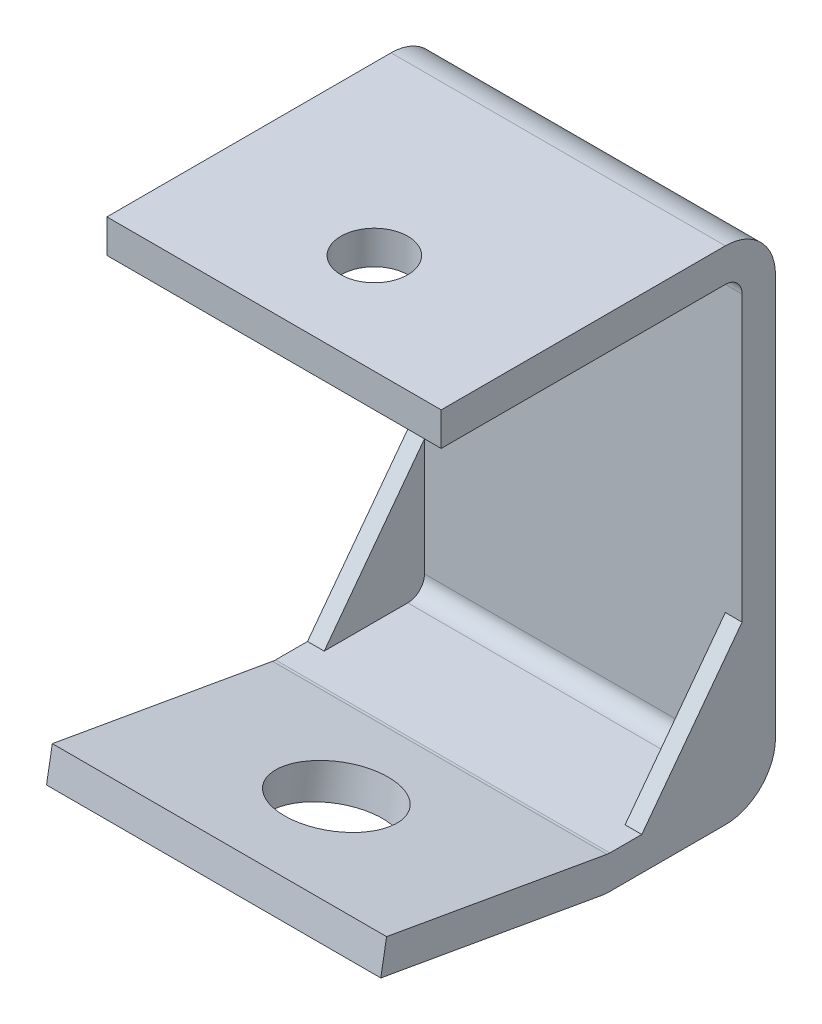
ISO-10303-21;
HEADER;
FILE_DESCRIPTION(('STEP AP214'),'2;1');
FILE_NAME('part.step','',(''),(''),'','','');
FILE_SCHEMA(('AUTOMOTIVE_DESIGN { 1 0 10303 214 1 1 1 1 }'));
ENDSEC;
DATA;
#1=APPLICATION_CONTEXT('core data for automotive mechanical design processes');
#2=APPLICATION_PROTOCOL_DEFINITION('international standard','automotive_design',2000,#1);
#3=PRODUCT_CONTEXT('',#1,'mechanical');
#4=PRODUCT('Part','Part','',(#3));
#5=PRODUCT_RELATED_PRODUCT_CATEGORY('part','',(#4));
#6=PRODUCT_DEFINITION_FORMATION('','',#4);
#7=PRODUCT_DEFINITION_CONTEXT('part definition',#1,'design');
#8=PRODUCT_DEFINITION('design','',#6,#7);
#9=PRODUCT_DEFINITION_SHAPE('','',#8);
#10=(LENGTH_UNIT() NAMED_UNIT(*) SI_UNIT(.MILLI.,.METRE.));
#11=(NAMED_UNIT(*) PLANE_ANGLE_UNIT() SI_UNIT($,.RADIAN.));
#12=(NAMED_UNIT(*) SI_UNIT($,.STERADIAN.) SOLID_ANGLE_UNIT());
#13=UNCERTAINTY_MEASURE_WITH_UNIT(LENGTH_MEASURE(1.E-05),#10,'distance_accuracy_value','');
#14=(GEOMETRIC_REPRESENTATION_CONTEXT(3) GLOBAL_UNCERTAINTY_ASSIGNED_CONTEXT((#13)) GLOBAL_UNIT_ASSIGNED_CONTEXT((#10,
#11,#12)) REPRESENTATION_CONTEXT('',''));
#15=CARTESIAN_POINT('',(0.,0.,0.));
#16=DIRECTION('',(0.,0.,1.));
#17=DIRECTION('',(1.,0.,0.));
#18=AXIS2_PLACEMENT_3D('',#15,#16,#17);
#19=CARTESIAN_POINT('',(31.75,3.175,3.175));
#20=DIRECTION('',(-1.,0.,0.));
#21=DIRECTION('',(0.,0.,1.));
#22=AXIS2_PLACEMENT_3D('',#19,#20,#21);
#23=CYLINDRICAL_SURFACE('',#22,3.175);
#24=DIRECTION('',(-1.,0.,0.));
#25=VECTOR('',#24,1.);
#26=CARTESIAN_POINT('',(31.75,3.175,0.));
#27=LINE('',#26,#25);
#28=CARTESIAN_POINT('',(28.575,3.175,0.));
#29=VERTEX_POINT('',#28);
#30=CARTESIAN_POINT('',(-28.575,3.175,0.));
#31=VERTEX_POINT('',#30);
#32=EDGE_CURVE('E325',#29,#31,#27,.T.);
#33=ORIENTED_EDGE('',*,*,#32,.T.);
#34=CARTESIAN_POINT('',(-28.575,3.175,3.175));
#35=DIRECTION('',(1.,0.,0.));
#36=DIRECTION('',(0.,0.,-1.));
#37=AXIS2_PLACEMENT_3D('',#34,#35,#36);
#38=CIRCLE('',#37,3.175);
#39=CARTESIAN_POINT('',(-28.575,0.,3.175));
#40=VERTEX_POINT('',#39);
#41=EDGE_CURVE('E197',#40,#31,#38,.T.);
#42=ORIENTED_EDGE('',*,*,#41,.F.);
#43=DIRECTION('',(-1.,0.,0.));
#44=VECTOR('',#43,1.);
#45=CARTESIAN_POINT('',(31.75,0.,3.175));
#46=LINE('',#45,#44);
#47=CARTESIAN_POINT('',(28.575,0.,3.175));
#48=VERTEX_POINT('',#47);
#49=EDGE_CURVE('E196',#48,#40,#46,.T.);
#50=ORIENTED_EDGE('',*,*,#49,.F.);
#51=CARTESIAN_POINT('',(28.575,3.175,3.175));
#52=DIRECTION('',(1.,0.,0.));
#53=DIRECTION('',(0.,0.,-1.));
#54=AXIS2_PLACEMENT_3D('',#51,#52,#53);
#55=CIRCLE('',#54,3.175);
#56=EDGE_CURVE('E208',#48,#29,#55,.T.);
#57=ORIENTED_EDGE('',*,*,#56,.T.);
#58=EDGE_LOOP('',(#33,#42,#50,#57));
#59=FACE_BOUND('',#58,.T.);
#60=ADVANCED_FACE('F37',(#59),#23,.F.);
#61=CARTESIAN_POINT('',(31.75,3.175,0.));
#62=DIRECTION('',(0.,0.,1.));
#63=DIRECTION('',(1.,0.,0.));
#64=AXIS2_PLACEMENT_3D('',#61,#62,#63);
#65=PLANE('',#64);
#66=DIRECTION('',(-1.,0.,0.));
#67=VECTOR('',#66,1.);
#68=CARTESIAN_POINT('',(-28.575,25.4,0.));
#69=LINE('',#68,#67);
#70=CARTESIAN_POINT('',(-28.575,25.4,0.));
#71=VERTEX_POINT('',#70);
#72=CARTESIAN_POINT('',(-31.75,25.4,0.));
#73=VERTEX_POINT('',#72);
#74=EDGE_CURVE('E184',#71,#73,#69,.T.);
#75=ORIENTED_EDGE('',*,*,#74,.F.);
#76=DIRECTION('',(0.,1.,0.));
#77=VECTOR('',#76,1.);
#78=CARTESIAN_POINT('',(-28.575,3.175,0.));
#79=LINE('',#78,#77);
#80=EDGE_CURVE('E191',#31,#71,#79,.T.);
#81=ORIENTED_EDGE('',*,*,#80,.F.);
#82=ORIENTED_EDGE('',*,*,#32,.F.);
#83=DIRECTION('',(0.,1.,0.));
#84=VECTOR('',#83,1.);
#85=CARTESIAN_POINT('',(28.575,3.175,0.));
#86=LINE('',#85,#84);
#87=CARTESIAN_POINT('',(28.575,25.4,0.));
#88=VERTEX_POINT('',#87);
#89=EDGE_CURVE('E61',#29,#88,#86,.T.);
#90=ORIENTED_EDGE('',*,*,#89,.T.);
#91=DIRECTION('',(1.,0.,0.));
#92=VECTOR('',#91,1.);
#93=CARTESIAN_POINT('',(28.575,25.4,0.));
#94=LINE('',#93,#92);
#95=CARTESIAN_POINT('',(31.75,25.4,0.));
#96=VERTEX_POINT('',#95);
#97=EDGE_CURVE('E217',#88,#96,#94,.T.);
#98=ORIENTED_EDGE('',*,*,#97,.T.);
#99=DIRECTION('',(0.,1.,0.));
#100=VECTOR('',#99,1.);
#101=CARTESIAN_POINT('',(31.75,3.175,0.));
#102=LINE('',#101,#100);
#103=CARTESIAN_POINT('',(31.75,79.375,0.));
#104=VERTEX_POINT('',#103);
#105=EDGE_CURVE('E238',#96,#104,#102,.T.);
#106=ORIENTED_EDGE('',*,*,#105,.T.);
#107=DIRECTION('',(-1.,0.,0.));
#108=VECTOR('',#107,1.);
#109=CARTESIAN_POINT('',(31.75,79.375,0.));
#110=LINE('',#109,#108);
#111=CARTESIAN_POINT('',(-31.75,79.375,0.));
#112=VERTEX_POINT('',#111);
#113=EDGE_CURVE('E328',#104,#112,#110,.T.);
#114=ORIENTED_EDGE('',*,*,#113,.T.);
#115=DIRECTION('',(0.,1.,0.));
#116=VECTOR('',#115,1.);
#117=CARTESIAN_POINT('',(-31.75,3.175,0.));
#118=LINE('',#117,#116);
#119=EDGE_CURVE('E275',#73,#112,#118,.T.);
#120=ORIENTED_EDGE('',*,*,#119,.F.);
#121=EDGE_LOOP('',(#75,#81,#82,#90,#98,#106,#114,#120));
#122=FACE_BOUND('',#121,.T.);
#123=ADVANCED_FACE('F418',(#122),#65,.T.);
#124=CARTESIAN_POINT('',(31.75,0.,25.1222234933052));
#125=DIRECTION('',(0.,1.,0.));
#126=DIRECTION('',(0.,0.,1.));
#127=AXIS2_PLACEMENT_3D('',#124,#125,#126);
#128=PLANE('',#127);
#129=DIRECTION('',(-1.,0.,0.));
#130=VECTOR('',#129,1.);
#131=CARTESIAN_POINT('',(-28.575,0.,19.05));
#132=LINE('',#131,#130);
#133=CARTESIAN_POINT('',(-28.575,0.,19.05));
#134=VERTEX_POINT('',#133);
#135=CARTESIAN_POINT('',(-31.75,0.,19.05));
#136=VERTEX_POINT('',#135);
#137=EDGE_CURVE('E175',#134,#136,#132,.T.);
#138=ORIENTED_EDGE('',*,*,#137,.T.);
#139=DIRECTION('',(0.,0.,-1.));
#140=VECTOR('',#139,1.);
#141=CARTESIAN_POINT('',(-31.75,0.,25.1222234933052));
#142=LINE('',#141,#140);
#143=CARTESIAN_POINT('',(-31.75,0.,25.1222234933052));
#144=VERTEX_POINT('',#143);
#145=EDGE_CURVE('E277',#144,#136,#142,.T.);
#146=ORIENTED_EDGE('',*,*,#145,.F.);
#147=DIRECTION('',(-1.,0.,0.));
#148=VECTOR('',#147,1.);
#149=CARTESIAN_POINT('',(31.75,0.,25.1222234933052));
#150=LINE('',#149,#148);
#151=CARTESIAN_POINT('',(31.75,0.,25.1222234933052));
#152=VERTEX_POINT('',#151);
#153=EDGE_CURVE('E322',#152,#144,#150,.T.);
#154=ORIENTED_EDGE('',*,*,#153,.F.);
#155=DIRECTION('',(0.,0.,-1.));
#156=VECTOR('',#155,1.);
#157=CARTESIAN_POINT('',(31.75,0.,25.1222234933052));
#158=LINE('',#157,#156);
#159=CARTESIAN_POINT('',(31.75,0.,19.05));
#160=VERTEX_POINT('',#159);
#161=EDGE_CURVE('E240',#152,#160,#158,.T.);
#162=ORIENTED_EDGE('',*,*,#161,.T.);
#163=DIRECTION('',(1.,0.,0.));
#164=VECTOR('',#163,1.);
#165=CARTESIAN_POINT('',(28.575,0.,19.05));
#166=LINE('',#165,#164);
#167=CARTESIAN_POINT('',(28.575,0.,19.05));
#168=VERTEX_POINT('',#167);
#169=EDGE_CURVE('E212',#168,#160,#166,.T.);
#170=ORIENTED_EDGE('',*,*,#169,.F.);
#171=DIRECTION('',(0.,0.,-1.));
#172=VECTOR('',#171,1.);
#173=CARTESIAN_POINT('',(28.575,0.,19.05));
#174=LINE('',#173,#172);
#175=EDGE_CURVE('E210',#168,#48,#174,.T.);
#176=ORIENTED_EDGE('',*,*,#175,.T.);
#177=ORIENTED_EDGE('',*,*,#49,.T.);
#178=DIRECTION('',(0.,0.,-1.));
#179=VECTOR('',#178,1.);
#180=CARTESIAN_POINT('',(-28.575,0.,19.05));
#181=LINE('',#180,#179);
#182=EDGE_CURVE('E188',#134,#40,#181,.T.);
#183=ORIENTED_EDGE('',*,*,#182,.F.);
#184=EDGE_LOOP('',(#138,#146,#154,#162,#170,#176,#177,#183));
#185=FACE_BOUND('',#184,.T.);
#186=ADVANCED_FACE('F194',(#185),#128,.T.);
#187=CARTESIAN_POINT('',(31.75,88.9,3.175));
#188=DIRECTION('',(0.,-1.,0.));
#189=DIRECTION('',(0.,0.,-1.));
#190=AXIS2_PLACEMENT_3D('',#187,#188,#189);
#191=PLANE('',#190);
#192=CARTESIAN_POINT('',(0.,88.9,38.1));
#193=DIRECTION('',(0.,1.,0.));
#194=DIRECTION('',(0.,0.,1.));
#195=AXIS2_PLACEMENT_3D('',#192,#193,#194);
#196=CIRCLE('',#195,6.35);
#197=CARTESIAN_POINT('',(0.,88.9,44.45));
#198=VERTEX_POINT('',#197);
#199=EDGE_CURVE('E222',#198,#198,#196,.T.);
#200=ORIENTED_EDGE('',*,*,#199,.F.);
#201=EDGE_LOOP('',(#200));
#202=FACE_BOUND('',#201,.T.);
#203=DIRECTION('',(0.,0.,1.));
#204=VECTOR('',#203,1.);
#205=CARTESIAN_POINT('',(-31.75,88.9,3.175));
#206=LINE('',#205,#204);
#207=CARTESIAN_POINT('',(-31.75,88.9,3.175));
#208=VERTEX_POINT('',#207);
#209=CARTESIAN_POINT('',(-31.75,88.9,57.15));
#210=VERTEX_POINT('',#209);
#211=EDGE_CURVE('E225',#208,#210,#206,.T.);
#212=ORIENTED_EDGE('',*,*,#211,.T.);
#213=DIRECTION('',(-1.,0.,0.));
#214=VECTOR('',#213,1.);
#215=CARTESIAN_POINT('',(31.75,88.9,57.15));
#216=LINE('',#215,#214);
#217=CARTESIAN_POINT('',(31.75,88.9,57.15));
#218=VERTEX_POINT('',#217);
#219=EDGE_CURVE('E11',#218,#210,#216,.T.);
#220=ORIENTED_EDGE('',*,*,#219,.F.);
#221=DIRECTION('',(0.,0.,1.));
#222=VECTOR('',#221,1.);
#223=CARTESIAN_POINT('',(31.75,88.9,3.175));
#224=LINE('',#223,#222);
#225=CARTESIAN_POINT('',(31.75,88.9,3.175));
#226=VERTEX_POINT('',#225);
#227=EDGE_CURVE('E226',#226,#218,#224,.T.);
#228=ORIENTED_EDGE('',*,*,#227,.F.);
#229=DIRECTION('',(-1.,0.,0.));
#230=VECTOR('',#229,1.);
#231=CARTESIAN_POINT('',(31.75,88.9,3.175));
#232=LINE('',#231,#230);
#233=EDGE_CURVE('E263',#226,#208,#232,.T.);
#234=ORIENTED_EDGE('',*,*,#233,.T.);
#235=EDGE_LOOP('',(#212,#220,#228,#234));
#236=FACE_BOUND('',#235,.T.);
#237=ADVANCED_FACE('F39',(#202,#236),#191,.F.);
#238=CARTESIAN_POINT('',(31.75,82.55,57.15));
#239=DIRECTION('',(0.,0.,1.));
#240=DIRECTION('',(1.,0.,0.));
#241=AXIS2_PLACEMENT_3D('',#238,#239,#240);
#242=PLANE('',#241);
#243=DIRECTION('',(0.,1.,0.));
#244=VECTOR('',#243,1.);
#245=CARTESIAN_POINT('',(-31.75,82.55,57.15));
#246=LINE('',#245,#244);
#247=CARTESIAN_POINT('',(-31.75,82.55,57.15));
#248=VERTEX_POINT('',#247);
#249=EDGE_CURVE('E266',#248,#210,#246,.T.);
#250=ORIENTED_EDGE('',*,*,#249,.F.);
#251=DIRECTION('',(-1.,0.,0.));
#252=VECTOR('',#251,1.);
#253=CARTESIAN_POINT('',(31.75,82.55,57.15));
#254=LINE('',#253,#252);
#255=CARTESIAN_POINT('',(31.75,82.55,57.15));
#256=VERTEX_POINT('',#255);
#257=EDGE_CURVE('E46',#256,#248,#254,.T.);
#258=ORIENTED_EDGE('',*,*,#257,.F.);
#259=DIRECTION('',(0.,1.,0.));
#260=VECTOR('',#259,1.);
#261=CARTESIAN_POINT('',(31.75,82.55,57.15));
#262=LINE('',#261,#260);
#263=EDGE_CURVE('E228',#256,#218,#262,.T.);
#264=ORIENTED_EDGE('',*,*,#263,.T.);
#265=ORIENTED_EDGE('',*,*,#219,.T.);
#266=EDGE_LOOP('',(#250,#258,#264,#265));
#267=FACE_BOUND('',#266,.T.);
#268=ADVANCED_FACE('F340',(#267),#242,.T.);
#269=CARTESIAN_POINT('',(31.75,82.55,3.175));
#270=DIRECTION('',(0.,-1.,0.));
#271=DIRECTION('',(0.,0.,-1.));
#272=AXIS2_PLACEMENT_3D('',#269,#270,#271);
#273=PLANE('',#272);
#274=CARTESIAN_POINT('',(0.,82.55,38.1));
#275=DIRECTION('',(0.,-1.,0.));
#276=DIRECTION('',(0.,0.,-1.));
#277=AXIS2_PLACEMENT_3D('',#274,#275,#276);
#278=CIRCLE('',#277,6.35);
#279=CARTESIAN_POINT('',(0.,82.55,31.75));
#280=VERTEX_POINT('',#279);
#281=EDGE_CURVE('E219',#280,#280,#278,.F.);
#282=ORIENTED_EDGE('',*,*,#281,.T.);
#283=EDGE_LOOP('',(#282));
#284=FACE_BOUND('',#283,.T.);
#285=DIRECTION('',(0.,0.,1.));
#286=VECTOR('',#285,1.);
#287=CARTESIAN_POINT('',(-31.75,82.55,3.175));
#288=LINE('',#287,#286);
#289=CARTESIAN_POINT('',(-31.75,82.55,3.175));
#290=VERTEX_POINT('',#289);
#291=EDGE_CURVE('E269',#290,#248,#288,.T.);
#292=ORIENTED_EDGE('',*,*,#291,.F.);
#293=DIRECTION('',(-1.,0.,0.));
#294=VECTOR('',#293,1.);
#295=CARTESIAN_POINT('',(31.75,82.55,3.175));
#296=LINE('',#295,#294);
#297=CARTESIAN_POINT('',(31.75,82.55,3.175));
#298=VERTEX_POINT('',#297);
#299=EDGE_CURVE('E331',#298,#290,#296,.T.);
#300=ORIENTED_EDGE('',*,*,#299,.F.);
#301=DIRECTION('',(0.,0.,1.));
#302=VECTOR('',#301,1.);
#303=CARTESIAN_POINT('',(31.75,82.55,3.175));
#304=LINE('',#303,#302);
#305=EDGE_CURVE('E232',#298,#256,#304,.T.);
#306=ORIENTED_EDGE('',*,*,#305,.T.);
#307=ORIENTED_EDGE('',*,*,#257,.T.);
#308=EDGE_LOOP('',(#292,#300,#306,#307));
#309=FACE_BOUND('',#308,.T.);
#310=ADVANCED_FACE('F336',(#284,#309),#273,.T.);
#311=CARTESIAN_POINT('',(31.75,79.375,3.175));
#312=DIRECTION('',(-1.,0.,0.));
#313=DIRECTION('',(0.,0.,1.));
#314=AXIS2_PLACEMENT_3D('',#311,#312,#313);
#315=CYLINDRICAL_SURFACE('',#314,3.175);
#316=CARTESIAN_POINT('',(-31.75,79.375,3.175));
#317=DIRECTION('',(1.,0.,0.));
#318=DIRECTION('',(0.,0.,-1.));
#319=AXIS2_PLACEMENT_3D('',#316,#317,#318);
#320=CIRCLE('',#319,3.175);
#321=EDGE_CURVE('E272',#112,#290,#320,.T.);
#322=ORIENTED_EDGE('',*,*,#321,.F.);
#323=ORIENTED_EDGE('',*,*,#113,.F.);
#324=CARTESIAN_POINT('',(31.75,79.375,3.175));
#325=DIRECTION('',(1.,0.,0.));
#326=DIRECTION('',(0.,0.,-1.));
#327=AXIS2_PLACEMENT_3D('',#324,#325,#326);
#328=CIRCLE('',#327,3.175);
#329=EDGE_CURVE('E235',#104,#298,#328,.T.);
#330=ORIENTED_EDGE('',*,*,#329,.T.);
#331=ORIENTED_EDGE('',*,*,#299,.T.);
#332=EDGE_LOOP('',(#322,#323,#330,#331));
#333=FACE_BOUND('',#332,.T.);
#334=ADVANCED_FACE('F348',(#333),#315,.F.);
#335=CARTESIAN_POINT('',(31.75,3.175,25.1222234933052));
#336=DIRECTION('',(-1.,0.,0.));
#337=DIRECTION('',(0.,0.,1.));
#338=AXIS2_PLACEMENT_3D('',#335,#336,#337);
#339=CYLINDRICAL_SURFACE('',#338,3.175);
#340=CARTESIAN_POINT('',(-31.75,3.175,25.1222234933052));
#341=DIRECTION('',(1.,0.,0.));
#342=DIRECTION('',(0.,0.,-1.));
#343=AXIS2_PLACEMENT_3D('',#340,#341,#342);
#344=CIRCLE('',#343,3.175);
#345=CARTESIAN_POINT('',(-31.75,0.0482353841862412,25.6735564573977));
#346=VERTEX_POINT('',#345);
#347=EDGE_CURVE('E279',#346,#144,#344,.T.);
#348=ORIENTED_EDGE('',*,*,#347,.F.);
#349=DIRECTION('',(-1.,0.,0.));
#350=VECTOR('',#349,1.);
#351=CARTESIAN_POINT('',(31.75,0.0482353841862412,25.6735564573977));
#352=LINE('',#351,#350);
#353=CARTESIAN_POINT('',(31.75,0.0482353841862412,25.6735564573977));
#354=VERTEX_POINT('',#353);
#355=EDGE_CURVE('E320',#354,#346,#352,.T.);
#356=ORIENTED_EDGE('',*,*,#355,.F.);
#357=CARTESIAN_POINT('',(31.75,3.175,25.1222234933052));
#358=DIRECTION('',(1.,0.,0.));
#359=DIRECTION('',(0.,0.,-1.));
#360=AXIS2_PLACEMENT_3D('',#357,#358,#359);
#361=CIRCLE('',#360,3.175);
#362=EDGE_CURVE('E242',#354,#152,#361,.T.);
#363=ORIENTED_EDGE('',*,*,#362,.T.);
#364=ORIENTED_EDGE('',*,*,#153,.T.);
#365=EDGE_LOOP('',(#348,#356,#363,#364));
#366=FACE_BOUND('',#365,.T.);
#367=ADVANCED_FACE('F395',(#366),#339,.F.);
#368=CARTESIAN_POINT('',(31.75,7.42755769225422,67.523772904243));
#369=DIRECTION('',(0.,0.984807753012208,-0.173648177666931));
#370=DIRECTION('',(0.,0.173648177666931,0.984807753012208));
#371=AXIS2_PLACEMENT_3D('',#368,#369,#370);
#372=PLANE('',#371);
#373=CARTESIAN_POINT('',(0.,3.51215941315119,45.3184458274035));
#374=DIRECTION('',(0.,0.984807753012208,-0.173648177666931));
#375=DIRECTION('',(0.,0.173648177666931,0.984807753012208));
#376=AXIS2_PLACEMENT_3D('',#373,#374,#375);
#377=CIRCLE('',#376,9.99999999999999);
#378=CARTESIAN_POINT('',(0.,5.2486411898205,55.1665233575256));
#379=VERTEX_POINT('',#378);
#380=EDGE_CURVE('E553',#379,#379,#377,.T.);
#381=ORIENTED_EDGE('',*,*,#380,.F.);
#382=EDGE_LOOP('',(#381));
#383=FACE_BOUND('',#382,.T.);
#384=DIRECTION('',(0.,-0.173648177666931,-0.984807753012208));
#385=VECTOR('',#384,1.);
#386=CARTESIAN_POINT('',(-31.75,7.42755769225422,67.523772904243));
#387=LINE('',#386,#385);
#388=CARTESIAN_POINT('',(-31.75,7.42755769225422,67.523772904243));
#389=VERTEX_POINT('',#388);
#390=EDGE_CURVE('E282',#389,#346,#387,.T.);
#391=ORIENTED_EDGE('',*,*,#390,.F.);
#392=DIRECTION('',(-1.,0.,0.));
#393=VECTOR('',#392,1.);
#394=CARTESIAN_POINT('',(31.75,7.42755769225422,67.523772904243));
#395=LINE('',#394,#393);
#396=CARTESIAN_POINT('',(31.75,7.42755769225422,67.523772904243));
#397=VERTEX_POINT('',#396);
#398=EDGE_CURVE('E318',#397,#389,#395,.T.);
#399=ORIENTED_EDGE('',*,*,#398,.F.);
#400=DIRECTION('',(0.,-0.173648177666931,-0.984807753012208));
#401=VECTOR('',#400,1.);
#402=CARTESIAN_POINT('',(31.75,7.42755769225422,67.523772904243));
#403=LINE('',#402,#401);
#404=EDGE_CURVE('E245',#397,#354,#403,.T.);
#405=ORIENTED_EDGE('',*,*,#404,.T.);
#406=ORIENTED_EDGE('',*,*,#355,.T.);
#407=EDGE_LOOP('',(#391,#399,#405,#406));
#408=FACE_BOUND('',#407,.T.);
#409=ADVANCED_FACE('F392',(#383,#408),#372,.T.);
#410=CARTESIAN_POINT('',(31.75,1.1740284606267,68.626438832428));
#411=DIRECTION('',(0.,0.17364817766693,0.984807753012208));
#412=DIRECTION('',(0.,-0.984807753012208,0.17364817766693));
#413=AXIS2_PLACEMENT_3D('',#410,#411,#412);
#414=PLANE('',#413);
#415=DIRECTION('',(0.,0.984807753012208,-0.17364817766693));
#416=VECTOR('',#415,1.);
#417=CARTESIAN_POINT('',(-31.75,1.1740284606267,68.626438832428));
#418=LINE('',#417,#416);
#419=CARTESIAN_POINT('',(-31.75,1.1740284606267,68.626438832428));
#420=VERTEX_POINT('',#419);
#421=EDGE_CURVE('E285',#420,#389,#418,.T.);
#422=ORIENTED_EDGE('',*,*,#421,.F.);
#423=DIRECTION('',(-1.,0.,0.));
#424=VECTOR('',#423,1.);
#425=CARTESIAN_POINT('',(31.75,1.1740284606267,68.626438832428));
#426=LINE('',#425,#424);
#427=CARTESIAN_POINT('',(31.75,1.1740284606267,68.626438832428));
#428=VERTEX_POINT('',#427);
#429=EDGE_CURVE('E316',#428,#420,#426,.T.);
#430=ORIENTED_EDGE('',*,*,#429,.F.);
#431=DIRECTION('',(0.,0.984807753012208,-0.17364817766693));
#432=VECTOR('',#431,1.);
#433=CARTESIAN_POINT('',(31.75,1.1740284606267,68.626438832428));
#434=LINE('',#433,#432);
#435=EDGE_CURVE('E248',#428,#397,#434,.T.);
#436=ORIENTED_EDGE('',*,*,#435,.T.);
#437=ORIENTED_EDGE('',*,*,#398,.T.);
#438=EDGE_LOOP('',(#422,#430,#436,#437));
#439=FACE_BOUND('',#438,.T.);
#440=ADVANCED_FACE('F388',(#439),#414,.T.);
#441=CARTESIAN_POINT('',(31.75,1.1740284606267,68.626438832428));
#442=DIRECTION('',(0.,0.984807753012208,-0.173648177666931));
#443=DIRECTION('',(0.,0.173648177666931,0.984807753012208));
#444=AXIS2_PLACEMENT_3D('',#441,#442,#443);
#445=PLANE('',#444);
#446=CARTESIAN_POINT('',(0.,-2.74136981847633,46.4211117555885));
#447=DIRECTION('',(0.,0.984807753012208,-0.173648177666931));
#448=DIRECTION('',(0.,0.173648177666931,0.984807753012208));
#449=AXIS2_PLACEMENT_3D('',#446,#447,#448);
#450=CIRCLE('',#449,9.99999999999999);
#451=CARTESIAN_POINT('',(0.,-1.00488804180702,56.2691892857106));
#452=VERTEX_POINT('',#451);
#453=EDGE_CURVE('E41',#452,#452,#450,.T.);
#454=ORIENTED_EDGE('',*,*,#453,.T.);
#455=EDGE_LOOP('',(#454));
#456=FACE_BOUND('',#455,.T.);
#457=DIRECTION('',(0.,-0.173648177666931,-0.984807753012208));
#458=VECTOR('',#457,1.);
#459=CARTESIAN_POINT('',(-31.75,1.1740284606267,68.626438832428));
#460=LINE('',#459,#458);
#461=CARTESIAN_POINT('',(-31.75,-6.20529384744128,26.7762223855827));
#462=VERTEX_POINT('',#461);
#463=EDGE_CURVE('E288',#420,#462,#460,.T.);
#464=ORIENTED_EDGE('',*,*,#463,.T.);
#465=DIRECTION('',(-1.,0.,0.));
#466=VECTOR('',#465,1.);
#467=CARTESIAN_POINT('',(31.75,-6.20529384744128,26.7762223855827));
#468=LINE('',#467,#466);
#469=CARTESIAN_POINT('',(31.75,-6.20529384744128,26.7762223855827));
#470=VERTEX_POINT('',#469);
#471=EDGE_CURVE('E313',#470,#462,#468,.T.);
#472=ORIENTED_EDGE('',*,*,#471,.F.);
#473=DIRECTION('',(0.,-0.173648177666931,-0.984807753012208));
#474=VECTOR('',#473,1.);
#475=CARTESIAN_POINT('',(31.75,1.1740284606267,68.626438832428));
#476=LINE('',#475,#474);
#477=EDGE_CURVE('E251',#428,#470,#476,.T.);
#478=ORIENTED_EDGE('',*,*,#477,.F.);
#479=ORIENTED_EDGE('',*,*,#429,.T.);
#480=EDGE_LOOP('',(#464,#472,#478,#479));
#481=FACE_BOUND('',#480,.T.);
#482=ADVANCED_FACE('F384',(#456,#481),#445,.F.);
#483=CARTESIAN_POINT('',(31.75,3.175,25.1222234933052));
#484=DIRECTION('',(-1.,0.,0.));
#485=DIRECTION('',(0.,0.,1.));
#486=AXIS2_PLACEMENT_3D('',#483,#484,#485);
#487=CYLINDRICAL_SURFACE('',#486,9.525);
#488=CARTESIAN_POINT('',(-31.75,3.175,25.1222234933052));
#489=DIRECTION('',(1.,0.,0.));
#490=DIRECTION('',(0.,0.,-1.));
#491=AXIS2_PLACEMENT_3D('',#488,#489,#490);
#492=CIRCLE('',#491,9.525);
#493=CARTESIAN_POINT('',(-31.75,-6.35,25.1222234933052));
#494=VERTEX_POINT('',#493);
#495=EDGE_CURVE('E290',#462,#494,#492,.T.);
#496=ORIENTED_EDGE('',*,*,#495,.T.);
#497=DIRECTION('',(-1.,0.,0.));
#498=VECTOR('',#497,1.);
#499=CARTESIAN_POINT('',(31.75,-6.35,25.1222234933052));
#500=LINE('',#499,#498);
#501=CARTESIAN_POINT('',(31.75,-6.35,25.1222234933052));
#502=VERTEX_POINT('',#501);
#503=EDGE_CURVE('E310',#502,#494,#500,.T.);
#504=ORIENTED_EDGE('',*,*,#503,.F.);
#505=CARTESIAN_POINT('',(31.75,3.175,25.1222234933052));
#506=DIRECTION('',(1.,0.,0.));
#507=DIRECTION('',(0.,0.,-1.));
#508=AXIS2_PLACEMENT_3D('',#505,#506,#507);
#509=CIRCLE('',#508,9.525);
#510=EDGE_CURVE('E253',#470,#502,#509,.T.);
#511=ORIENTED_EDGE('',*,*,#510,.F.);
#512=ORIENTED_EDGE('',*,*,#471,.T.);
#513=EDGE_LOOP('',(#496,#504,#511,#512));
#514=FACE_BOUND('',#513,.T.);
#515=ADVANCED_FACE('F380',(#514),#487,.T.);
#516=CARTESIAN_POINT('',(31.75,-6.35,25.1222234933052));
#517=DIRECTION('',(0.,1.,0.));
#518=DIRECTION('',(0.,0.,1.));
#519=AXIS2_PLACEMENT_3D('',#516,#517,#518);
#520=PLANE('',#519);
#521=DIRECTION('',(0.,0.,-1.));
#522=VECTOR('',#521,1.);
#523=CARTESIAN_POINT('',(-31.75,-6.35,25.1222234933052));
#524=LINE('',#523,#522);
#525=CARTESIAN_POINT('',(-31.75,-6.35,3.175));
#526=VERTEX_POINT('',#525);
#527=EDGE_CURVE('E292',#494,#526,#524,.T.);
#528=ORIENTED_EDGE('',*,*,#527,.T.);
#529=DIRECTION('',(-1.,0.,0.));
#530=VECTOR('',#529,1.);
#531=CARTESIAN_POINT('',(31.75,-6.35,3.175));
#532=LINE('',#531,#530);
#533=CARTESIAN_POINT('',(31.75,-6.35,3.175));
#534=VERTEX_POINT('',#533);
#535=EDGE_CURVE('E307',#534,#526,#532,.T.);
#536=ORIENTED_EDGE('',*,*,#535,.F.);
#537=DIRECTION('',(0.,0.,-1.));
#538=VECTOR('',#537,1.);
#539=CARTESIAN_POINT('',(31.75,-6.35,25.1222234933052));
#540=LINE('',#539,#538);
#541=EDGE_CURVE('E255',#502,#534,#540,.T.);
#542=ORIENTED_EDGE('',*,*,#541,.F.);
#543=ORIENTED_EDGE('',*,*,#503,.T.);
#544=EDGE_LOOP('',(#528,#536,#542,#543));
#545=FACE_BOUND('',#544,.T.);
#546=ADVANCED_FACE('F375',(#545),#520,.F.);
#547=CARTESIAN_POINT('',(31.75,3.175,3.175));
#548=DIRECTION('',(-1.,0.,0.));
#549=DIRECTION('',(0.,0.,1.));
#550=AXIS2_PLACEMENT_3D('',#547,#548,#549);
#551=CYLINDRICAL_SURFACE('',#550,9.525);
#552=CARTESIAN_POINT('',(-31.75,3.175,3.175));
#553=DIRECTION('',(1.,0.,0.));
#554=DIRECTION('',(0.,0.,-1.));
#555=AXIS2_PLACEMENT_3D('',#552,#553,#554);
#556=CIRCLE('',#555,9.525);
#557=CARTESIAN_POINT('',(-31.75,3.175,-6.35));
#558=VERTEX_POINT('',#557);
#559=EDGE_CURVE('E294',#526,#558,#556,.T.);
#560=ORIENTED_EDGE('',*,*,#559,.T.);
#561=DIRECTION('',(-1.,0.,0.));
#562=VECTOR('',#561,1.);
#563=CARTESIAN_POINT('',(31.75,3.175,-6.35));
#564=LINE('',#563,#562);
#565=CARTESIAN_POINT('',(31.75,3.175,-6.35));
#566=VERTEX_POINT('',#565);
#567=EDGE_CURVE('E304',#566,#558,#564,.T.);
#568=ORIENTED_EDGE('',*,*,#567,.F.);
#569=CARTESIAN_POINT('',(31.75,3.175,3.175));
#570=DIRECTION('',(1.,0.,0.));
#571=DIRECTION('',(0.,0.,-1.));
#572=AXIS2_PLACEMENT_3D('',#569,#570,#571);
#573=CIRCLE('',#572,9.525);
#574=EDGE_CURVE('E257',#534,#566,#573,.T.);
#575=ORIENTED_EDGE('',*,*,#574,.F.);
#576=ORIENTED_EDGE('',*,*,#535,.T.);
#577=EDGE_LOOP('',(#560,#568,#575,#576));
#578=FACE_BOUND('',#577,.T.);
#579=ADVANCED_FACE('F369',(#578),#551,.T.);
#580=CARTESIAN_POINT('',(31.75,3.175,-6.35));
#581=DIRECTION('',(0.,0.,1.));
#582=DIRECTION('',(1.,0.,0.));
#583=AXIS2_PLACEMENT_3D('',#580,#581,#582);
#584=PLANE('',#583);
#585=DIRECTION('',(0.,1.,0.));
#586=VECTOR('',#585,1.);
#587=CARTESIAN_POINT('',(-31.75,3.175,-6.35));
#588=LINE('',#587,#586);
#589=CARTESIAN_POINT('',(-31.75,79.375,-6.35));
#590=VERTEX_POINT('',#589);
#591=EDGE_CURVE('E296',#558,#590,#588,.T.);
#592=ORIENTED_EDGE('',*,*,#591,.T.);
#593=DIRECTION('',(-1.,0.,0.));
#594=VECTOR('',#593,1.);
#595=CARTESIAN_POINT('',(31.75,79.375,-6.35));
#596=LINE('',#595,#594);
#597=CARTESIAN_POINT('',(31.75,79.375,-6.35));
#598=VERTEX_POINT('',#597);
#599=EDGE_CURVE('E301',#598,#590,#596,.T.);
#600=ORIENTED_EDGE('',*,*,#599,.F.);
#601=DIRECTION('',(0.,1.,0.));
#602=VECTOR('',#601,1.);
#603=CARTESIAN_POINT('',(31.75,3.175,-6.35));
#604=LINE('',#603,#602);
#605=EDGE_CURVE('E259',#566,#598,#604,.T.);
#606=ORIENTED_EDGE('',*,*,#605,.F.);
#607=ORIENTED_EDGE('',*,*,#567,.T.);
#608=EDGE_LOOP('',(#592,#600,#606,#607));
#609=FACE_BOUND('',#608,.T.);
#610=ADVANCED_FACE('F365',(#609),#584,.F.);
#611=CARTESIAN_POINT('',(31.75,79.375,3.175));
#612=DIRECTION('',(-1.,0.,0.));
#613=DIRECTION('',(0.,0.,1.));
#614=AXIS2_PLACEMENT_3D('',#611,#612,#613);
#615=CYLINDRICAL_SURFACE('',#614,9.525);
#616=CARTESIAN_POINT('',(-31.75,79.375,3.175));
#617=DIRECTION('',(1.,0.,0.));
#618=DIRECTION('',(0.,0.,-1.));
#619=AXIS2_PLACEMENT_3D('',#616,#617,#618);
#620=CIRCLE('',#619,9.525);
#621=EDGE_CURVE('E229',#590,#208,#620,.T.);
#622=ORIENTED_EDGE('',*,*,#621,.T.);
#623=ORIENTED_EDGE('',*,*,#233,.F.);
#624=CARTESIAN_POINT('',(31.75,79.375,3.175));
#625=DIRECTION('',(1.,0.,0.));
#626=DIRECTION('',(0.,0.,-1.));
#627=AXIS2_PLACEMENT_3D('',#624,#625,#626);
#628=CIRCLE('',#627,9.525);
#629=EDGE_CURVE('E261',#598,#226,#628,.T.);
#630=ORIENTED_EDGE('',*,*,#629,.F.);
#631=ORIENTED_EDGE('',*,*,#599,.T.);
#632=EDGE_LOOP('',(#622,#623,#630,#631));
#633=FACE_BOUND('',#632,.T.);
#634=ADVANCED_FACE('F361',(#633),#615,.T.);
#635=CARTESIAN_POINT('',(31.75,79.375,3.175));
#636=DIRECTION('',(1.,0.,0.));
#637=DIRECTION('',(0.,0.,-1.));
#638=AXIS2_PLACEMENT_3D('',#635,#636,#637);
#639=PLANE('',#638);
#640=ORIENTED_EDGE('',*,*,#105,.F.);
#641=DIRECTION('',(0.,0.8,-0.6));
#642=VECTOR('',#641,1.);
#643=CARTESIAN_POINT('',(31.75,0.,19.05));
#644=LINE('',#643,#642);
#645=EDGE_CURVE('E183',#160,#96,#644,.T.);
#646=ORIENTED_EDGE('',*,*,#645,.F.);
#647=ORIENTED_EDGE('',*,*,#161,.F.);
#648=ORIENTED_EDGE('',*,*,#362,.F.);
#649=ORIENTED_EDGE('',*,*,#404,.F.);
#650=ORIENTED_EDGE('',*,*,#435,.F.);
#651=ORIENTED_EDGE('',*,*,#477,.T.);
#652=ORIENTED_EDGE('',*,*,#510,.T.);
#653=ORIENTED_EDGE('',*,*,#541,.T.);
#654=ORIENTED_EDGE('',*,*,#574,.T.);
#655=ORIENTED_EDGE('',*,*,#605,.T.);
#656=ORIENTED_EDGE('',*,*,#629,.T.);
#657=ORIENTED_EDGE('',*,*,#227,.T.);
#658=ORIENTED_EDGE('',*,*,#263,.F.);
#659=ORIENTED_EDGE('',*,*,#305,.F.);
#660=ORIENTED_EDGE('',*,*,#329,.F.);
#661=EDGE_LOOP('',(#640,#646,#647,#648,#649,#650,#651,#652,#653,#654,#655,#656,#657,#658,#659,#660));
#662=FACE_BOUND('',#661,.T.);
#663=ADVANCED_FACE('F352',(#662),#639,.T.);
#664=CARTESIAN_POINT('',(-31.75,79.375,3.175));
#665=DIRECTION('',(1.,0.,0.));
#666=DIRECTION('',(0.,0.,-1.));
#667=AXIS2_PLACEMENT_3D('',#664,#665,#666);
#668=PLANE('',#667);
#669=ORIENTED_EDGE('',*,*,#211,.F.);
#670=ORIENTED_EDGE('',*,*,#621,.F.);
#671=ORIENTED_EDGE('',*,*,#591,.F.);
#672=ORIENTED_EDGE('',*,*,#559,.F.);
#673=ORIENTED_EDGE('',*,*,#527,.F.);
#674=ORIENTED_EDGE('',*,*,#495,.F.);
#675=ORIENTED_EDGE('',*,*,#463,.F.);
#676=ORIENTED_EDGE('',*,*,#421,.T.);
#677=ORIENTED_EDGE('',*,*,#390,.T.);
#678=ORIENTED_EDGE('',*,*,#347,.T.);
#679=ORIENTED_EDGE('',*,*,#145,.T.);
#680=DIRECTION('',(0.,0.8,-0.6));
#681=VECTOR('',#680,1.);
#682=CARTESIAN_POINT('',(-31.75,0.,19.05));
#683=LINE('',#682,#681);
#684=EDGE_CURVE('E53',#136,#73,#683,.T.);
#685=ORIENTED_EDGE('',*,*,#684,.T.);
#686=ORIENTED_EDGE('',*,*,#119,.T.);
#687=ORIENTED_EDGE('',*,*,#321,.T.);
#688=ORIENTED_EDGE('',*,*,#291,.T.);
#689=ORIENTED_EDGE('',*,*,#249,.T.);
#690=EDGE_LOOP('',(#669,#670,#671,#672,#673,#674,#675,#676,#677,#678,#679,#685,#686,#687,#688,#689));
#691=FACE_BOUND('',#690,.T.);
#692=ADVANCED_FACE('F343',(#691),#668,.F.);
#693=CARTESIAN_POINT('',(0.,-6.35100000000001,38.1000000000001));
#694=DIRECTION('',(0.,1.,0.));
#695=DIRECTION('',(0.,0.,1.));
#696=AXIS2_PLACEMENT_3D('',#693,#694,#695);
#697=CYLINDRICAL_SURFACE('',#696,6.35);
#698=ORIENTED_EDGE('',*,*,#281,.F.);
#699=EDGE_LOOP('',(#698));
#700=FACE_BOUND('',#699,.T.);
#701=ORIENTED_EDGE('',*,*,#199,.T.);
#702=EDGE_LOOP('',(#701));
#703=FACE_BOUND('',#702,.T.);
#704=ADVANCED_FACE('F416',(#700,#703),#697,.F.);
#705=CARTESIAN_POINT('',(28.575,0.,19.05));
#706=DIRECTION('',(0.,-0.6,-0.8));
#707=DIRECTION('',(0.,0.8,-0.6));
#708=AXIS2_PLACEMENT_3D('',#705,#706,#707);
#709=PLANE('',#708);
#710=ORIENTED_EDGE('',*,*,#645,.T.);
#711=ORIENTED_EDGE('',*,*,#97,.F.);
#712=DIRECTION('',(0.,0.8,-0.6));
#713=VECTOR('',#712,1.);
#714=CARTESIAN_POINT('',(28.575,0.,19.05));
#715=LINE('',#714,#713);
#716=EDGE_CURVE('E205',#168,#88,#715,.T.);
#717=ORIENTED_EDGE('',*,*,#716,.F.);
#718=ORIENTED_EDGE('',*,*,#169,.T.);
#719=EDGE_LOOP('',(#710,#711,#717,#718));
#720=FACE_BOUND('',#719,.T.);
#721=ADVANCED_FACE('F401',(#720),#709,.F.);
#722=CARTESIAN_POINT('',(28.575,3.175,3.175));
#723=DIRECTION('',(1.,0.,0.));
#724=DIRECTION('',(0.,0.,-1.));
#725=AXIS2_PLACEMENT_3D('',#722,#723,#724);
#726=PLANE('',#725);
#727=ORIENTED_EDGE('',*,*,#716,.T.);
#728=ORIENTED_EDGE('',*,*,#89,.F.);
#729=ORIENTED_EDGE('',*,*,#56,.F.);
#730=ORIENTED_EDGE('',*,*,#175,.F.);
#731=EDGE_LOOP('',(#727,#728,#729,#730));
#732=FACE_BOUND('',#731,.T.);
#733=ADVANCED_FACE('F407',(#732),#726,.F.);
#734=CARTESIAN_POINT('',(-28.575,0.,19.05));
#735=DIRECTION('',(0.,0.6,0.8));
#736=DIRECTION('',(0.,-0.8,0.6));
#737=AXIS2_PLACEMENT_3D('',#734,#735,#736);
#738=PLANE('',#737);
#739=ORIENTED_EDGE('',*,*,#684,.F.);
#740=ORIENTED_EDGE('',*,*,#137,.F.);
#741=DIRECTION('',(0.,0.8,-0.6));
#742=VECTOR('',#741,1.);
#743=CARTESIAN_POINT('',(-28.575,0.,19.05));
#744=LINE('',#743,#742);
#745=EDGE_CURVE('E178',#134,#71,#744,.T.);
#746=ORIENTED_EDGE('',*,*,#745,.T.);
#747=ORIENTED_EDGE('',*,*,#74,.T.);
#748=EDGE_LOOP('',(#739,#740,#746,#747));
#749=FACE_BOUND('',#748,.T.);
#750=ADVANCED_FACE('F177',(#749),#738,.T.);
#751=CARTESIAN_POINT('',(-28.575,3.175,3.175));
#752=DIRECTION('',(-1.,0.,0.));
#753=DIRECTION('',(0.,0.,-1.));
#754=AXIS2_PLACEMENT_3D('',#751,#752,#753);
#755=PLANE('',#754);
#756=ORIENTED_EDGE('',*,*,#745,.F.);
#757=ORIENTED_EDGE('',*,*,#182,.T.);
#758=ORIENTED_EDGE('',*,*,#41,.T.);
#759=ORIENTED_EDGE('',*,*,#80,.T.);
#760=EDGE_LOOP('',(#756,#757,#758,#759));
#761=FACE_BOUND('',#760,.T.);
#762=ADVANCED_FACE('F187',(#761),#755,.F.);
#763=CARTESIAN_POINT('',(0.,-10.0385210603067,47.7077964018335));
#764=DIRECTION('',(0.,0.984807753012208,-0.173648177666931));
#765=DIRECTION('',(0.,0.173648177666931,0.984807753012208));
#766=AXIS2_PLACEMENT_3D('',#763,#764,#765);
#767=CYLINDRICAL_SURFACE('',#766,9.99999999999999);
#768=ORIENTED_EDGE('',*,*,#380,.T.);
#769=EDGE_LOOP('',(#768));
#770=FACE_BOUND('',#769,.T.);
#771=ORIENTED_EDGE('',*,*,#453,.F.);
#772=EDGE_LOOP('',(#771));
#773=FACE_BOUND('',#772,.T.);
#774=ADVANCED_FACE('F533',(#770,#773),#767,.F.);
#775=CLOSED_SHELL('',(#60,#123,#186,#237,#268,#310,#334,#367,#409,#440,#482,#515,#546,#579,#610,
#634,#663,#692,#704,#721,#733,#750,#762,#774));
#776=MANIFOLD_SOLID_BREP('B2',#775);
#777=ADVANCED_BREP_SHAPE_REPRESENTATION('',(#18,#776),#14);
#778=SHAPE_DEFINITION_REPRESENTATION(#9,#777);
ENDSEC;
END-ISO-10303-21;
